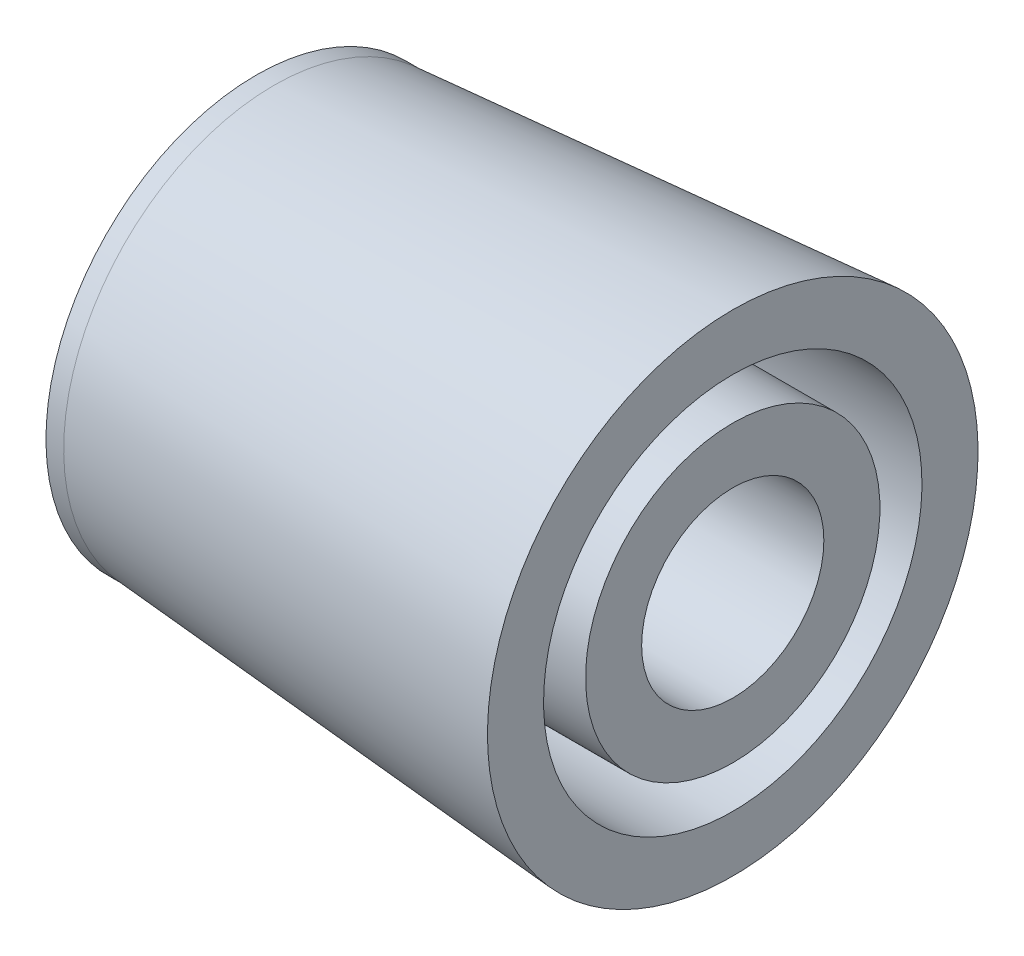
ISO-10303-21;
HEADER;
FILE_DESCRIPTION(('STEP AP214'),'2;1');
FILE_NAME('part.step','',(''),(''),'','','');
FILE_SCHEMA(('AUTOMOTIVE_DESIGN { 1 0 10303 214 1 1 1 1 }'));
ENDSEC;
DATA;
#1=APPLICATION_CONTEXT('core data for automotive mechanical design processes');
#2=APPLICATION_PROTOCOL_DEFINITION('international standard','automotive_design',2000,#1);
#3=PRODUCT_CONTEXT('',#1,'mechanical');
#4=PRODUCT('Part','Part','',(#3));
#5=PRODUCT_RELATED_PRODUCT_CATEGORY('part','',(#4));
#6=PRODUCT_DEFINITION_FORMATION('','',#4);
#7=PRODUCT_DEFINITION_CONTEXT('part definition',#1,'design');
#8=PRODUCT_DEFINITION('design','',#6,#7);
#9=PRODUCT_DEFINITION_SHAPE('','',#8);
#10=(LENGTH_UNIT() NAMED_UNIT(*) SI_UNIT(.MILLI.,.METRE.));
#11=(NAMED_UNIT(*) PLANE_ANGLE_UNIT() SI_UNIT($,.RADIAN.));
#12=(NAMED_UNIT(*) SI_UNIT($,.STERADIAN.) SOLID_ANGLE_UNIT());
#13=UNCERTAINTY_MEASURE_WITH_UNIT(LENGTH_MEASURE(1.E-05),#10,'distance_accuracy_value','');
#14=(GEOMETRIC_REPRESENTATION_CONTEXT(3) GLOBAL_UNCERTAINTY_ASSIGNED_CONTEXT((#13)) GLOBAL_UNIT_ASSIGNED_CONTEXT((#10,
#11,#12)) REPRESENTATION_CONTEXT('',''));
#15=CARTESIAN_POINT('',(0.,0.,0.));
#16=DIRECTION('',(0.,0.,1.));
#17=DIRECTION('',(1.,0.,0.));
#18=AXIS2_PLACEMENT_3D('',#15,#16,#17);
#19=CARTESIAN_POINT('',(24.6136753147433,-1.62278714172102,0.));
#20=DIRECTION('',(-1.,0.,0.));
#21=DIRECTION('',(0.,-1.,0.));
#22=AXIS2_PLACEMENT_3D('',#19,#20,#21);
#23=PLANE('',#22);
#24=CARTESIAN_POINT('',(24.6136753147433,-1.62278714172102,0.));
#25=DIRECTION('',(1.,0.,0.));
#26=DIRECTION('',(0.,1.,0.));
#27=AXIS2_PLACEMENT_3D('',#24,#25,#26);
#28=CIRCLE('',#27,7.5);
#29=CARTESIAN_POINT('',(24.6136753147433,5.87721285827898,0.));
#30=VERTEX_POINT('',#29);
#31=EDGE_CURVE('E10',#30,#30,#28,.T.);
#32=ORIENTED_EDGE('',*,*,#31,.F.);
#33=EDGE_LOOP('',(#32));
#34=FACE_BOUND('',#33,.T.);
#35=ADVANCED_FACE('F34',(#34),#23,.T.);
#36=CARTESIAN_POINT('',(26.6136753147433,-1.62278714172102,0.));
#37=DIRECTION('',(1.,0.,0.));
#38=DIRECTION('',(0.,1.,0.));
#39=AXIS2_PLACEMENT_3D('',#36,#37,#38);
#40=CYLINDRICAL_SURFACE('',#39,7.5);
#41=ORIENTED_EDGE('',*,*,#31,.T.);
#42=EDGE_LOOP('',(#41));
#43=FACE_BOUND('',#42,.T.);
#44=CARTESIAN_POINT('',(25.2462893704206,-1.62278714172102,0.));
#45=DIRECTION('',(1.,0.,0.));
#46=DIRECTION('',(0.,1.,0.));
#47=AXIS2_PLACEMENT_3D('',#44,#45,#46);
#48=CIRCLE('',#47,7.5);
#49=CARTESIAN_POINT('',(25.2462893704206,5.87721285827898,0.));
#50=VERTEX_POINT('',#49);
#51=EDGE_CURVE('E40',#50,#50,#48,.T.);
#52=ORIENTED_EDGE('',*,*,#51,.F.);
#53=EDGE_LOOP('',(#52));
#54=FACE_BOUND('',#53,.T.);
#55=ADVANCED_FACE('F85',(#43,#54),#40,.T.);
#56=CARTESIAN_POINT('',(41.6136753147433,-1.62278714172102,0.));
#57=DIRECTION('',(1.,0.,0.));
#58=DIRECTION('',(0.,1.,0.));
#59=AXIS2_PLACEMENT_3D('',#56,#57,#58);
#60=CONICAL_SURFACE('',#59,8.75,0.0762234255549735);
#61=ORIENTED_EDGE('',*,*,#51,.T.);
#62=EDGE_LOOP('',(#61));
#63=FACE_BOUND('',#62,.T.);
#64=CARTESIAN_POINT('',(41.6136753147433,-1.62278714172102,0.));
#65=DIRECTION('',(1.,0.,0.));
#66=DIRECTION('',(0.,1.,0.));
#67=AXIS2_PLACEMENT_3D('',#64,#65,#66);
#68=CIRCLE('',#67,8.75);
#69=CARTESIAN_POINT('',(41.6136753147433,7.12721285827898,0.));
#70=VERTEX_POINT('',#69);
#71=EDGE_CURVE('E44',#70,#70,#68,.T.);
#72=ORIENTED_EDGE('',*,*,#71,.F.);
#73=EDGE_LOOP('',(#72));
#74=FACE_BOUND('',#73,.T.);
#75=ADVANCED_FACE('F90',(#63,#74),#60,.T.);
#76=CARTESIAN_POINT('',(41.6136753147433,7.12721285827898,0.));
#77=DIRECTION('',(1.,0.,0.));
#78=DIRECTION('',(0.,1.,0.));
#79=AXIS2_PLACEMENT_3D('',#76,#77,#78);
#80=PLANE('',#79);
#81=ORIENTED_EDGE('',*,*,#71,.T.);
#82=EDGE_LOOP('',(#81));
#83=FACE_BOUND('',#82,.T.);
#84=CARTESIAN_POINT('',(41.6136753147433,-1.62278714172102,0.));
#85=DIRECTION('',(1.,0.,0.));
#86=DIRECTION('',(0.,1.,0.));
#87=AXIS2_PLACEMENT_3D('',#84,#85,#86);
#88=CIRCLE('',#87,6.75);
#89=CARTESIAN_POINT('',(41.6136753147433,5.12721285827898,0.));
#90=VERTEX_POINT('',#89);
#91=EDGE_CURVE('E48',#90,#90,#88,.T.);
#92=ORIENTED_EDGE('',*,*,#91,.F.);
#93=EDGE_LOOP('',(#92));
#94=FACE_BOUND('',#93,.T.);
#95=ADVANCED_FACE('F94',(#83,#94),#80,.T.);
#96=CARTESIAN_POINT('',(26.6136753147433,-1.62278714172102,0.));
#97=DIRECTION('',(1.,0.,0.));
#98=DIRECTION('',(0.,1.,0.));
#99=AXIS2_PLACEMENT_3D('',#96,#97,#98);
#100=CYLINDRICAL_SURFACE('',#99,6.75);
#101=ORIENTED_EDGE('',*,*,#91,.T.);
#102=EDGE_LOOP('',(#101));
#103=FACE_BOUND('',#102,.T.);
#104=CARTESIAN_POINT('',(31.6136753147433,-1.62278714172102,0.));
#105=DIRECTION('',(1.,0.,0.));
#106=DIRECTION('',(0.,1.,0.));
#107=AXIS2_PLACEMENT_3D('',#104,#105,#106);
#108=CIRCLE('',#107,6.75);
#109=CARTESIAN_POINT('',(31.6136753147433,5.12721285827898,0.));
#110=VERTEX_POINT('',#109);
#111=EDGE_CURVE('E53',#110,#110,#108,.T.);
#112=ORIENTED_EDGE('',*,*,#111,.F.);
#113=EDGE_LOOP('',(#112));
#114=FACE_BOUND('',#113,.T.);
#115=ADVANCED_FACE('F100',(#103,#114),#100,.F.);
#116=CARTESIAN_POINT('',(31.6136753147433,5.12721285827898,0.));
#117=DIRECTION('',(1.,0.,0.));
#118=DIRECTION('',(0.,1.,0.));
#119=AXIS2_PLACEMENT_3D('',#116,#117,#118);
#120=PLANE('',#119);
#121=ORIENTED_EDGE('',*,*,#111,.T.);
#122=EDGE_LOOP('',(#121));
#123=FACE_BOUND('',#122,.T.);
#124=CARTESIAN_POINT('',(31.6136753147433,-1.62278714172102,0.));
#125=DIRECTION('',(1.,0.,0.));
#126=DIRECTION('',(0.,1.,0.));
#127=AXIS2_PLACEMENT_3D('',#124,#125,#126);
#128=CIRCLE('',#127,5.25);
#129=CARTESIAN_POINT('',(31.6136753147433,3.62721285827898,0.));
#130=VERTEX_POINT('',#129);
#131=EDGE_CURVE('E56',#130,#130,#128,.T.);
#132=ORIENTED_EDGE('',*,*,#131,.F.);
#133=EDGE_LOOP('',(#132));
#134=FACE_BOUND('',#133,.T.);
#135=ADVANCED_FACE('F104',(#123,#134),#120,.T.);
#136=CARTESIAN_POINT('',(26.6136753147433,-1.62278714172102,0.));
#137=DIRECTION('',(1.,0.,0.));
#138=DIRECTION('',(0.,1.,0.));
#139=AXIS2_PLACEMENT_3D('',#136,#137,#138);
#140=CYLINDRICAL_SURFACE('',#139,5.25);
#141=ORIENTED_EDGE('',*,*,#131,.T.);
#142=EDGE_LOOP('',(#141));
#143=FACE_BOUND('',#142,.T.);
#144=CARTESIAN_POINT('',(41.6136753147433,-1.62278714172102,0.));
#145=DIRECTION('',(1.,0.,0.));
#146=DIRECTION('',(0.,1.,0.));
#147=AXIS2_PLACEMENT_3D('',#144,#145,#146);
#148=CIRCLE('',#147,5.25);
#149=CARTESIAN_POINT('',(41.6136753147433,3.62721285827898,0.));
#150=VERTEX_POINT('',#149);
#151=EDGE_CURVE('E59',#150,#150,#148,.T.);
#152=ORIENTED_EDGE('',*,*,#151,.F.);
#153=EDGE_LOOP('',(#152));
#154=FACE_BOUND('',#153,.T.);
#155=ADVANCED_FACE('F81',(#143,#154),#140,.T.);
#156=CARTESIAN_POINT('',(41.6136753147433,3.62721285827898,0.));
#157=DIRECTION('',(1.,0.,0.));
#158=DIRECTION('',(0.,1.,0.));
#159=AXIS2_PLACEMENT_3D('',#156,#157,#158);
#160=PLANE('',#159);
#161=ORIENTED_EDGE('',*,*,#151,.T.);
#162=EDGE_LOOP('',(#161));
#163=FACE_BOUND('',#162,.T.);
#164=CARTESIAN_POINT('',(41.6136753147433,-1.62278714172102,0.));
#165=DIRECTION('',(1.,0.,0.));
#166=DIRECTION('',(0.,1.,0.));
#167=AXIS2_PLACEMENT_3D('',#164,#165,#166);
#168=CIRCLE('',#167,3.25);
#169=CARTESIAN_POINT('',(41.6136753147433,1.62721285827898,0.));
#170=VERTEX_POINT('',#169);
#171=EDGE_CURVE('E62',#170,#170,#168,.T.);
#172=ORIENTED_EDGE('',*,*,#171,.F.);
#173=EDGE_LOOP('',(#172));
#174=FACE_BOUND('',#173,.T.);
#175=ADVANCED_FACE('F73',(#163,#174),#160,.T.);
#176=CARTESIAN_POINT('',(26.6136753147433,-1.62278714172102,0.));
#177=DIRECTION('',(1.,0.,0.));
#178=DIRECTION('',(0.,1.,0.));
#179=AXIS2_PLACEMENT_3D('',#176,#177,#178);
#180=CYLINDRICAL_SURFACE('',#179,3.25);
#181=ORIENTED_EDGE('',*,*,#171,.T.);
#182=EDGE_LOOP('',(#181));
#183=FACE_BOUND('',#182,.T.);
#184=CARTESIAN_POINT('',(26.6136753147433,-1.62278714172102,0.));
#185=DIRECTION('',(1.,0.,0.));
#186=DIRECTION('',(0.,1.,0.));
#187=AXIS2_PLACEMENT_3D('',#184,#185,#186);
#188=CIRCLE('',#187,3.25);
#189=CARTESIAN_POINT('',(26.6136753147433,1.62721285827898,0.));
#190=VERTEX_POINT('',#189);
#191=EDGE_CURVE('E65',#190,#190,#188,.T.);
#192=ORIENTED_EDGE('',*,*,#191,.F.);
#193=EDGE_LOOP('',(#192));
#194=FACE_BOUND('',#193,.T.);
#195=ADVANCED_FACE('F71',(#183,#194),#180,.F.);
#196=CARTESIAN_POINT('',(26.6136753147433,1.62721285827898,0.));
#197=DIRECTION('',(1.,0.,0.));
#198=DIRECTION('',(0.,1.,0.));
#199=AXIS2_PLACEMENT_3D('',#196,#197,#198);
#200=PLANE('',#199);
#201=ORIENTED_EDGE('',*,*,#191,.T.);
#202=EDGE_LOOP('',(#201));
#203=FACE_BOUND('',#202,.T.);
#204=ADVANCED_FACE('F69',(#203),#200,.T.);
#205=CLOSED_SHELL('',(#35,#55,#75,#95,#115,#135,#155,#175,#195,#204));
#206=MANIFOLD_SOLID_BREP('B2',#205);
#207=ADVANCED_BREP_SHAPE_REPRESENTATION('',(#18,#206),#14);
#208=SHAPE_DEFINITION_REPRESENTATION(#9,#207);
ENDSEC;
END-ISO-10303-21;
